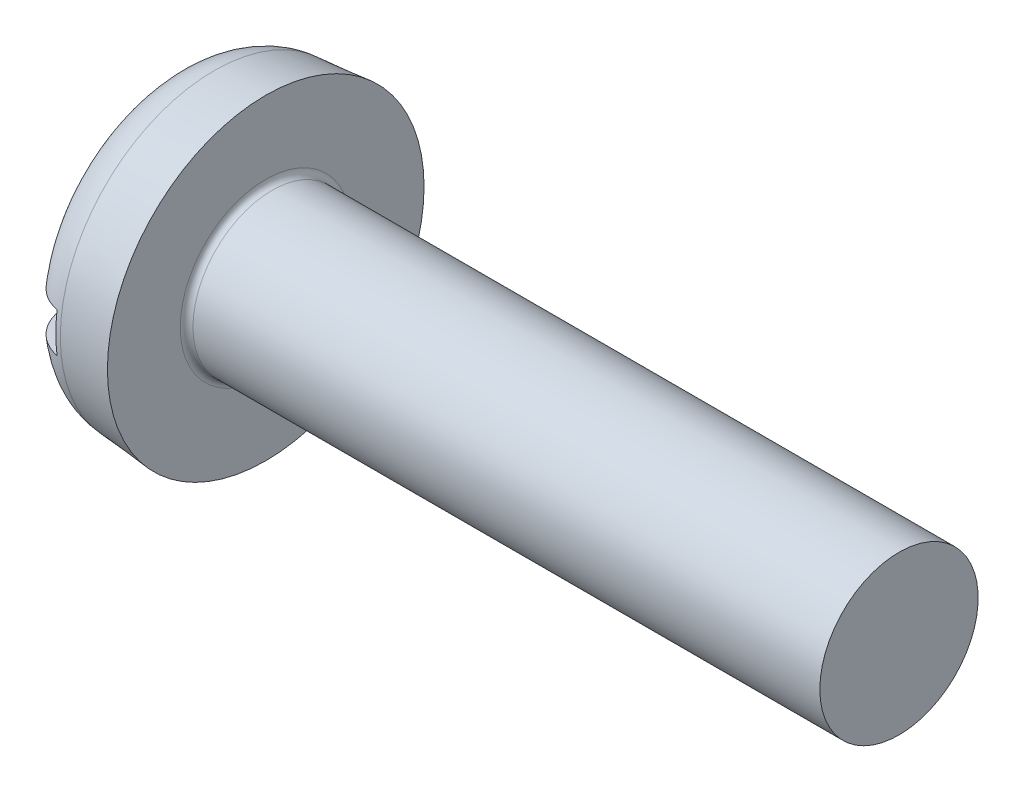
from build123d import *

# Parameters (mm, degrees)
FILLET_HEAD_R = 3
FILLET2_R     = 0.4
SLOTSKE_W     = 20
SLOTSKE_H     = 2.5
SLOT_DEPTH    = 2.4


with BuildPart() as part:
    # BodySke → BaseBody (revolve)
    with BuildSketch(Plane.XY, mode=Mode.PRIVATE) as basebody_sk:
        Polygon((0, 0), (0, 9.475068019), (6, 10), (6, 5), (46, 5), (46, 0), align=None)
    revolve(basebody_sk.sketch.rotate(Axis((0, 0, 0), (1, 0, 0)), 90), axis=Axis((0, 0, 0), (1, 0, 0)))

    # Fillet_head
    fillet_head_edges = [part.edges().sort_by_distance(p)[0] for p in [
        (0, 0, -9.475068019),
    ]]
    fillet(fillet_head_edges, radius=FILLET_HEAD_R)

    # Fillet2
    fillet2_edges = [part.edges().sort_by_distance(p)[0] for p in [
        (6, 0, -5),
    ]]
    fillet(fillet2_edges, radius=FILLET2_R)

    # SlotSke → Slot (cut)
    with BuildSketch(Plane.ZY):
        Rectangle(SLOTSKE_W, SLOTSKE_H)
    extrude(amount=-SLOT_DEPTH, mode=Mode.SUBTRACT)


solid = part.part
